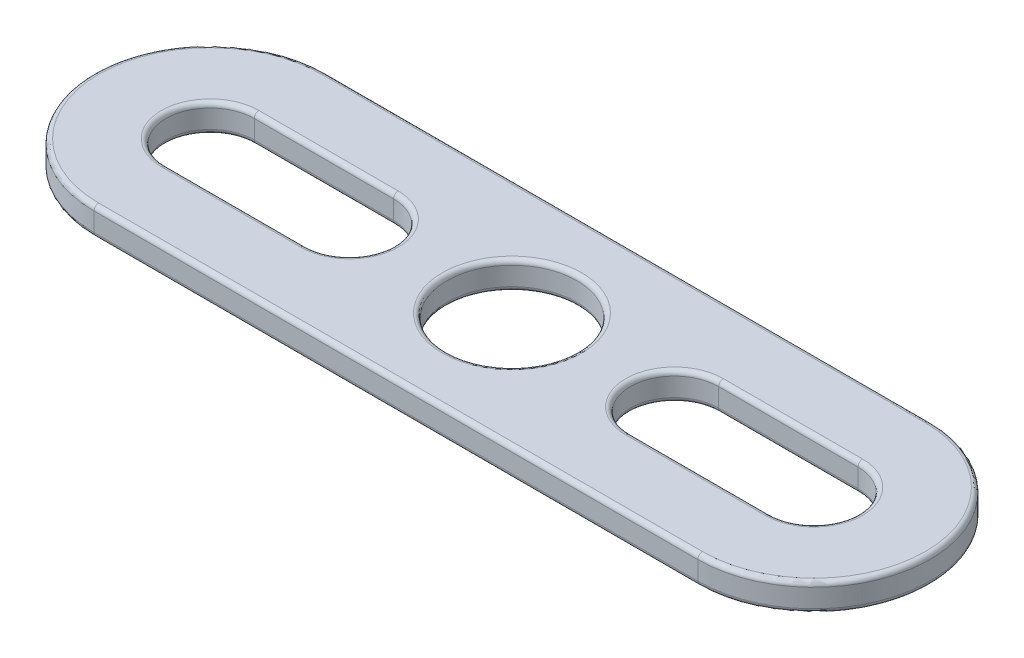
from build123d import *

# Parameters (mm, degrees)
SKETCH1_R      = 3.556
EXTRUDE1_DEPTH = 1.524
FILLET1_R      = 0.254


with BuildPart() as part:
    # Sketch1 → Extrude1 (new body)
    with BuildSketch(Plane(origin=(0, 0, 0), x_dir=(1, 0, 0), z_dir=(0, 1, 0))):
        with BuildLine():
            Line((0, 0), (33.02, 0))
            ThreePointArc((33.02, 0), (39.37, 6.35), (33.02, 12.7))
            Line((33.02, 12.7), (0, 12.7))
            ThreePointArc((0, 12.7), (-6.35, 6.35), (0, 0))
        make_face()
        with Locations(Location((16.51, 6.35, 0), (0, 0, 90))):
            Circle(SKETCH1_R, mode=Mode.SUBTRACT)
        with BuildLine():
            Line((0, 8.763), (7.62, 8.763))
            ThreePointArc((7.62, 8.763), (10.033, 6.35), (7.62, 3.937))
            Line((7.62, 3.937), (0, 3.937))
            ThreePointArc((0, 3.937), (-2.413, 6.35), (0, 8.763))
        make_face(mode=Mode.SUBTRACT)
        with BuildLine():
            Line((25.4, 8.763), (33.02, 8.763))
            ThreePointArc((33.02, 8.763), (35.433, 6.35), (33.02, 3.937))
            Line((33.02, 3.937), (25.4, 3.937))
            ThreePointArc((25.4, 3.937), (22.987, 6.35), (25.4, 8.763))
        make_face(mode=Mode.SUBTRACT)
    extrude(amount=EXTRUDE1_DEPTH)

    # Fillet1
    fillet1_edges = [part.edges().sort_by_distance(p)[0] for p in [
        (39.37, 1.524, -6.35),
        (16.51, 0, -2.794),
        (16.51, 1.524, -2.794),
        (16.51, 1.524, -12.7),
        (-2.413, 0, -6.35),
        (3.81, 0, -3.937),
        (10.033, 0, -6.35),
        (3.81, 0, -8.763),
        (-2.413, 1.524, -6.35),
        (3.81, 1.524, -3.937),
        (10.033, 1.524, -6.35),
        (3.81, 1.524, -8.763),
        (22.987, 0, -6.35),
        (29.21, 0, -3.937),
        (35.433, 0, -6.35),
        (29.21, 0, -8.763),
        (22.987, 1.524, -6.35),
        (29.21, 1.524, -3.937),
        (35.433, 1.524, -6.35),
        (29.21, 1.524, -8.763),
        (-6.35, 1.524, -6.35),
        (16.51, 0, -12.7),
        (39.37, 0, -6.35),
        (16.51, 0, 0),
        (-6.35, 0, -6.35),
        (16.51, 1.524, 0),
    ]]
    fillet(fillet1_edges, radius=FILLET1_R)


solid = part.part
